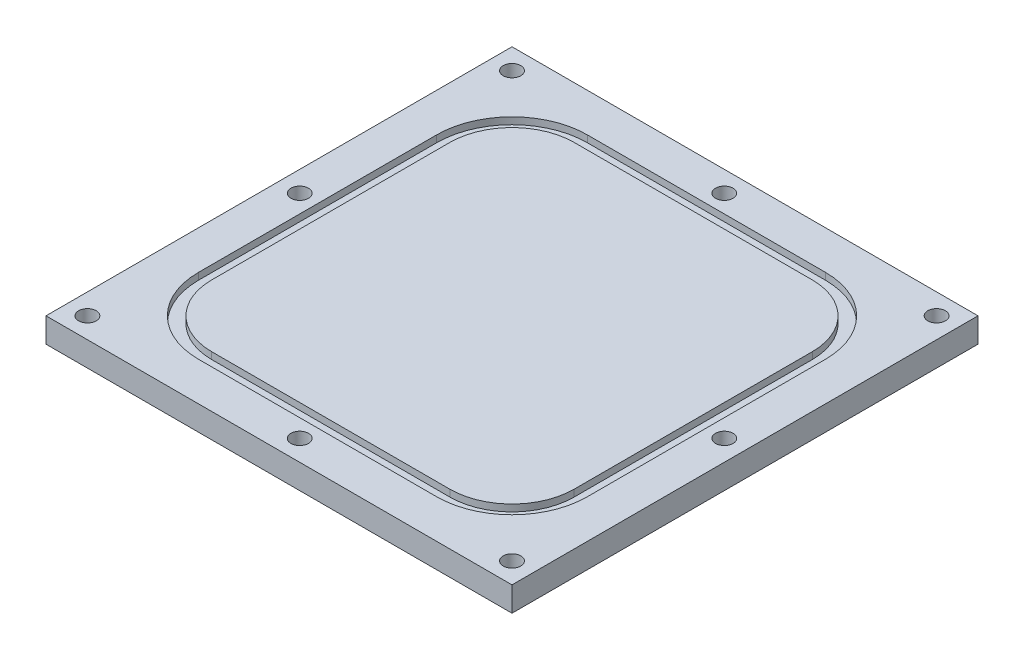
from build123d import *

# Parameters (mm, degrees)
SKETCH1_W                  = 90
SKETCH1_H                  = 90
BOSS_EXTRUDE1_DEPTH        = 4.7498
F_3_4_3_4_DIAMETER_HOLE1_D = 3.4
CUT_EXTRUDE2_DEPTH         = 1.3208


with BuildPart() as part:
    # Sketch1 → Boss-Extrude1 (new body)
    with BuildSketch(Plane(origin=(0, 0, 0), x_dir=(1, 0, 0), z_dir=(0, 1, 0))):
        Rectangle(SKETCH1_W, SKETCH1_H)
    extrude(amount=BOSS_EXTRUDE1_DEPTH)

    # 3.4 _3.4_ Diameter Hole1 (through all)
    with Locations(Plane.XZ):
        with Locations((-41, 41), (0, 41), (41, 41), (41, 0), (41, -41), (0, -41), (-41, -41), (-41, 0)):
            Hole(F_3_4_3_4_DIAMETER_HOLE1_D / 2)

    # Sketch9 → Cut-Extrude2 (cut)
    with BuildSketch(Plane(origin=(0, 4.7498, 0), x_dir=(1, 0, 0), z_dir=(0, 1, 0))):
        with BuildLine():
            Line((23, -37.54), (-23, -37.54))
            ThreePointArc((-23, -37.54), (-33.281332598, -33.281332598), (-37.54, -23))
            Line((-37.54, -23), (-37.54, 23))
            ThreePointArc((-37.54, 23), (-33.281332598, 33.281332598), (-23, 37.54))
            Line((-23, 37.54), (23, 37.54))
            ThreePointArc((23, 37.54), (33.281332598, 33.281332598), (37.54, 23))
            Line((37.54, 23), (37.54, -23))
            ThreePointArc((37.54, -23), (33.281332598, -33.281332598), (23, -37.54))
        make_face()
        with BuildLine():
            Line((23, -35), (-23, -35))
            ThreePointArc((-23, -35), (-31.485281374, -31.485281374), (-35, -23))
            Line((-35, -23), (-35, 23))
            ThreePointArc((-35, 23), (-31.485281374, 31.485281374), (-23, 35))
            Line((-23, 35), (23, 35))
            ThreePointArc((23, 35), (31.485281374, 31.485281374), (35, 23))
            Line((35, 23), (35, -23))
            ThreePointArc((35, -23), (31.485281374, -31.485281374), (23, -35))
        make_face(mode=Mode.SUBTRACT)
    extrude(amount=-CUT_EXTRUDE2_DEPTH, mode=Mode.SUBTRACT)


solid = part.part
